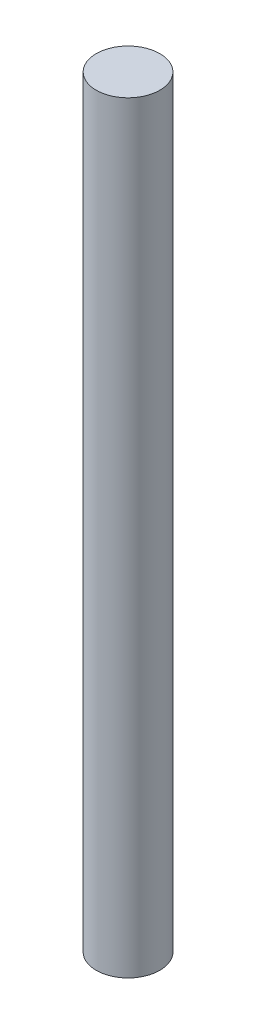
ISO-10303-21;
HEADER;
FILE_DESCRIPTION(('STEP AP214'),'2;1');
FILE_NAME('part.step','',(''),(''),'','','');
FILE_SCHEMA(('AUTOMOTIVE_DESIGN { 1 0 10303 214 1 1 1 1 }'));
ENDSEC;
DATA;
#1=APPLICATION_CONTEXT('core data for automotive mechanical design processes');
#2=APPLICATION_PROTOCOL_DEFINITION('international standard','automotive_design',2000,#1);
#3=PRODUCT_CONTEXT('',#1,'mechanical');
#4=PRODUCT('Part','Part','',(#3));
#5=PRODUCT_RELATED_PRODUCT_CATEGORY('part','',(#4));
#6=PRODUCT_DEFINITION_FORMATION('','',#4);
#7=PRODUCT_DEFINITION_CONTEXT('part definition',#1,'design');
#8=PRODUCT_DEFINITION('design','',#6,#7);
#9=PRODUCT_DEFINITION_SHAPE('','',#8);
#10=(LENGTH_UNIT() NAMED_UNIT(*) SI_UNIT(.MILLI.,.METRE.));
#11=(NAMED_UNIT(*) PLANE_ANGLE_UNIT() SI_UNIT($,.RADIAN.));
#12=(NAMED_UNIT(*) SI_UNIT($,.STERADIAN.) SOLID_ANGLE_UNIT());
#13=UNCERTAINTY_MEASURE_WITH_UNIT(LENGTH_MEASURE(1.E-05),#10,'distance_accuracy_value','');
#14=(GEOMETRIC_REPRESENTATION_CONTEXT(3) GLOBAL_UNCERTAINTY_ASSIGNED_CONTEXT((#13)) GLOBAL_UNIT_ASSIGNED_CONTEXT((#10,
#11,#12)) REPRESENTATION_CONTEXT('',''));
#15=CARTESIAN_POINT('',(0.,0.,0.));
#16=DIRECTION('',(0.,0.,1.));
#17=DIRECTION('',(1.,0.,0.));
#18=AXIS2_PLACEMENT_3D('',#15,#16,#17);
#19=CARTESIAN_POINT('',(0.,15.24,0.));
#20=DIRECTION('',(0.,-1.,0.));
#21=DIRECTION('',(0.,0.,-1.));
#22=AXIS2_PLACEMENT_3D('',#19,#20,#21);
#23=CYLINDRICAL_SURFACE('',#22,1.27);
#24=CARTESIAN_POINT('',(0.,15.24,0.));
#25=DIRECTION('',(0.,1.,0.));
#26=DIRECTION('',(0.,0.,1.));
#27=AXIS2_PLACEMENT_3D('',#24,#25,#26);
#28=CIRCLE('',#27,1.27);
#29=CARTESIAN_POINT('',(0.,15.24,-1.27));
#30=VERTEX_POINT('',#29);
#31=EDGE_CURVE('E10',#30,#30,#28,.T.);
#32=CARTESIAN_POINT('',(0.,-15.24,0.));
#33=DIRECTION('',(0.,1.,0.));
#34=DIRECTION('',(0.,0.,1.));
#35=AXIS2_PLACEMENT_3D('',#32,#33,#34);
#36=CIRCLE('',#35,1.27);
#37=CARTESIAN_POINT('',(0.,-15.24,-1.27));
#38=VERTEX_POINT('',#37);
#39=EDGE_CURVE('E33',#38,#38,#36,.T.);
#40=CARTESIAN_POINT('',(0.,15.24,-1.27));
#41=CARTESIAN_POINT('',(0.,14.9225,-1.27));
#42=CARTESIAN_POINT('',(0.,14.605,-1.27));
#43=CARTESIAN_POINT('',(0.,13.97,-1.27));
#44=CARTESIAN_POINT('',(0.,13.6525,-1.27));
#45=CARTESIAN_POINT('',(0.,13.0175,-1.27));
#46=CARTESIAN_POINT('',(0.,12.7,-1.27));
#47=CARTESIAN_POINT('',(0.,12.065,-1.27));
#48=CARTESIAN_POINT('',(0.,11.7475,-1.27));
#49=CARTESIAN_POINT('',(0.,11.1125,-1.27));
#50=CARTESIAN_POINT('',(0.,10.795,-1.27));
#51=CARTESIAN_POINT('',(0.,10.16,-1.27));
#52=CARTESIAN_POINT('',(0.,9.8425,-1.27));
#53=CARTESIAN_POINT('',(0.,9.2075,-1.27));
#54=CARTESIAN_POINT('',(0.,8.89,-1.27));
#55=CARTESIAN_POINT('',(0.,8.255,-1.27));
#56=CARTESIAN_POINT('',(0.,7.9375,-1.27));
#57=CARTESIAN_POINT('',(0.,7.3025,-1.27));
#58=CARTESIAN_POINT('',(0.,6.985,-1.27));
#59=CARTESIAN_POINT('',(0.,6.35,-1.27));
#60=CARTESIAN_POINT('',(0.,6.0325,-1.27));
#61=CARTESIAN_POINT('',(0.,5.3975,-1.27));
#62=CARTESIAN_POINT('',(0.,5.08,-1.27));
#63=CARTESIAN_POINT('',(0.,4.445,-1.27));
#64=CARTESIAN_POINT('',(0.,4.1275,-1.27));
#65=CARTESIAN_POINT('',(0.,3.4925,-1.27));
#66=CARTESIAN_POINT('',(0.,3.175,-1.27));
#67=CARTESIAN_POINT('',(0.,2.54,-1.27));
#68=CARTESIAN_POINT('',(0.,2.2225,-1.27));
#69=CARTESIAN_POINT('',(0.,1.5875,-1.27));
#70=CARTESIAN_POINT('',(0.,1.27,-1.27));
#71=CARTESIAN_POINT('',(0.,0.634999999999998,-1.27));
#72=CARTESIAN_POINT('',(0.,0.317499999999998,-1.27));
#73=CARTESIAN_POINT('',(0.,-0.3175,-1.27));
#74=CARTESIAN_POINT('',(0.,-0.634999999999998,-1.27));
#75=CARTESIAN_POINT('',(0.,-1.27,-1.27));
#76=CARTESIAN_POINT('',(0.,-1.5875,-1.27));
#77=CARTESIAN_POINT('',(0.,-2.2225,-1.27));
#78=CARTESIAN_POINT('',(0.,-2.54,-1.27));
#79=CARTESIAN_POINT('',(0.,-3.175,-1.27));
#80=CARTESIAN_POINT('',(0.,-3.4925,-1.27));
#81=CARTESIAN_POINT('',(0.,-4.1275,-1.27));
#82=CARTESIAN_POINT('',(0.,-4.445,-1.27));
#83=CARTESIAN_POINT('',(0.,-5.08,-1.27));
#84=CARTESIAN_POINT('',(0.,-5.3975,-1.27));
#85=CARTESIAN_POINT('',(0.,-6.0325,-1.27));
#86=CARTESIAN_POINT('',(0.,-6.35,-1.27));
#87=CARTESIAN_POINT('',(0.,-6.985,-1.27));
#88=CARTESIAN_POINT('',(0.,-7.3025,-1.27));
#89=CARTESIAN_POINT('',(0.,-7.9375,-1.27));
#90=CARTESIAN_POINT('',(0.,-8.255,-1.27));
#91=CARTESIAN_POINT('',(0.,-8.89,-1.27));
#92=CARTESIAN_POINT('',(0.,-9.2075,-1.27));
#93=CARTESIAN_POINT('',(0.,-9.8425,-1.27));
#94=CARTESIAN_POINT('',(0.,-10.16,-1.27));
#95=CARTESIAN_POINT('',(0.,-10.795,-1.27));
#96=CARTESIAN_POINT('',(0.,-11.1125,-1.27));
#97=CARTESIAN_POINT('',(0.,-11.7475,-1.27));
#98=CARTESIAN_POINT('',(0.,-12.065,-1.27));
#99=CARTESIAN_POINT('',(0.,-12.7,-1.27));
#100=CARTESIAN_POINT('',(0.,-13.0175,-1.27));
#101=CARTESIAN_POINT('',(0.,-13.6525,-1.27));
#102=CARTESIAN_POINT('',(0.,-13.97,-1.27));
#103=CARTESIAN_POINT('',(0.,-14.605,-1.27));
#104=CARTESIAN_POINT('',(0.,-14.9225,-1.27));
#105=CARTESIAN_POINT('',(0.,-15.24,-1.27));
#106=B_SPLINE_CURVE_WITH_KNOTS('',3,(#40,#41,#42,#43,#44,#45,#46,#47,#48,#49,#50,#51,#52,#53,
#54,#55,#56,#57,#58,#59,#60,#61,#62,#63,#64,#65,#66,#67,#68,#69,#70,#71,#72,#73,#74,#75,#76,#77,
#78,#79,#80,#81,#82,#83,#84,#85,#86,#87,#88,#89,#90,#91,#92,#93,#94,#95,#96,#97,#98,#99,#100,
#101,#102,#103,#104,#105),.UNSPECIFIED.,.F.,.F.,(4,2,2,2,2,2,2,2,2,2,2,2,2,2,2,2,2,2,2,2,2,2,2,
2,2,2,2,2,2,2,2,2,4),(0.,0.952499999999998,1.905,2.8575,3.81,4.7625,5.715,6.6675,7.62,8.5725,
9.525,10.4775,11.43,12.3825,13.335,14.2875,15.24,16.1925,17.145,18.0975,19.05,20.0025,20.955,
21.9075,22.86,23.8125,24.765,25.7175,26.67,27.6225,28.575,29.5275,30.48),.UNSPECIFIED.);
#107=EDGE_CURVE('BSEAM30',#30,#38,#106,.T.);
#108=ORIENTED_EDGE('',*,*,#31,.F.);
#109=ORIENTED_EDGE('',*,*,#39,.T.);
#110=ORIENTED_EDGE('',*,*,#107,.T.);
#111=ORIENTED_EDGE('',*,*,#107,.F.);
#112=EDGE_LOOP('',(#108,#110,#109,#111));
#113=FACE_BOUND('',#112,.T.);
#114=ADVANCED_FACE('F30',(#113),#23,.T.);
#115=CARTESIAN_POINT('',(0.,15.24,0.));
#116=DIRECTION('',(0.,1.,0.));
#117=DIRECTION('',(0.,0.,1.));
#118=AXIS2_PLACEMENT_3D('',#115,#116,#117);
#119=PLANE('',#118);
#120=ORIENTED_EDGE('',*,*,#31,.T.);
#121=EDGE_LOOP('',(#120));
#122=FACE_BOUND('',#121,.T.);
#123=ADVANCED_FACE('F45',(#122),#119,.T.);
#124=CARTESIAN_POINT('',(0.,-15.24,0.));
#125=DIRECTION('',(0.,1.,0.));
#126=DIRECTION('',(0.,0.,1.));
#127=AXIS2_PLACEMENT_3D('',#124,#125,#126);
#128=PLANE('',#127);
#129=ORIENTED_EDGE('',*,*,#39,.F.);
#130=EDGE_LOOP('',(#129));
#131=FACE_BOUND('',#130,.T.);
#132=ADVANCED_FACE('F43',(#131),#128,.F.);
#133=CLOSED_SHELL('',(#114,#123,#132));
#134=MANIFOLD_SOLID_BREP('B2',#133);
#135=ADVANCED_BREP_SHAPE_REPRESENTATION('',(#18,#134),#14);
#136=SHAPE_DEFINITION_REPRESENTATION(#9,#135);
ENDSEC;
END-ISO-10303-21;
